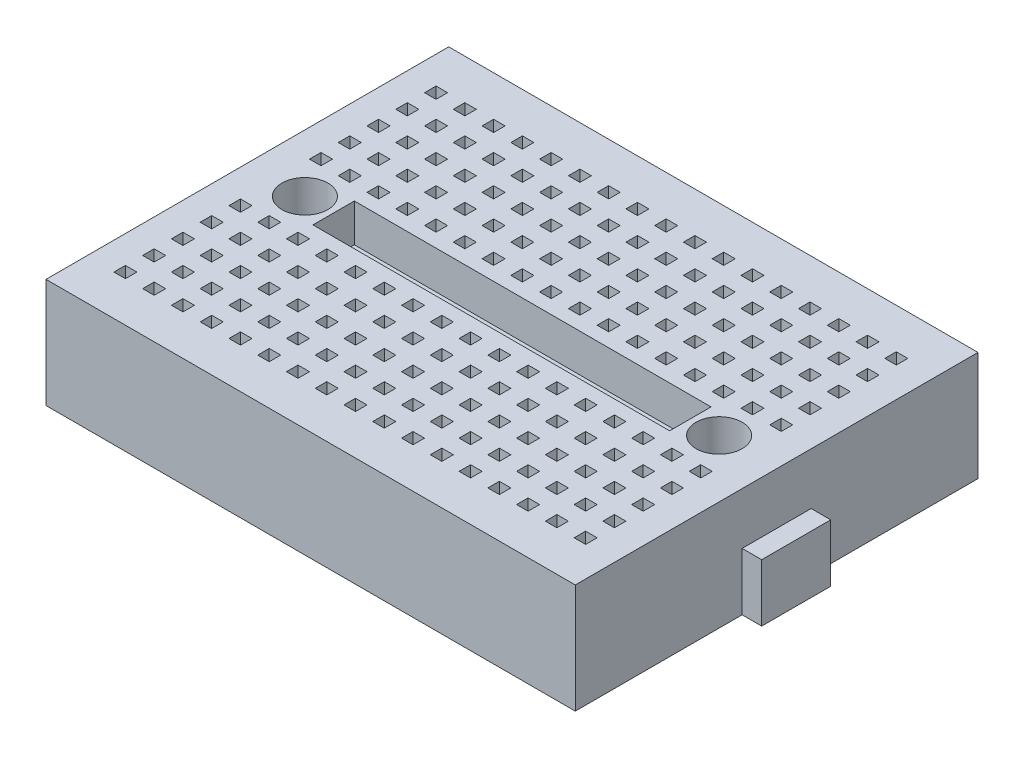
from build123d import *

# Parameters (mm, degrees)
CROQUIS1_W              = 46
CROQUIS1_H              = 35
SALIENTE_EXTRUIR1_DEPTH = 9.5
CROQUIS2_W              = 6
CROQUIS2_H              = 5
SALIENTE_EXTRUIR2_DEPTH = 1.7
CROQUIS3_W              = 31
CROQUIS3_H              = 3.6
CORTAR_EXTRUIR1_DEPTH   = 3.3
CROQUIS4_R              = 2
CORTAR_EXTRUIR2_DEPTH   = 3.5
CROQUIS5_W              = 4.5
CROQUIS5_H              = 5
SALIENTE_EXTRUIR3_DEPTH = 1.5
CROQUIS6_W              = 1
CROQUIS6_H              = 1
CORTAR_EXTRUIR3_DEPTH   = 3


with BuildPart() as part:
    # Croquis1 → Saliente-Extruir1 (new body)
    with BuildSketch(Plane(origin=(0, 0, 0), x_dir=(1, 0, 0), z_dir=(0, 1, 0))):
        with Locations((23, 17.5)):
            Rectangle(CROQUIS1_W, CROQUIS1_H)
    extrude(amount=SALIENTE_EXTRUIR1_DEPTH)

    # Croquis2 → Saliente-Extruir2 (add)
    with BuildSketch(Plane(origin=(46, 0, 0), x_dir=(0, 0, -1), z_dir=(1, 0, 0))):
        with Locations((17.5, 2.5)):
            Rectangle(CROQUIS2_W, CROQUIS2_H)
    extrude(amount=SALIENTE_EXTRUIR2_DEPTH)

    # Croquis3 → Cortar-Extruir1 (cut)
    with BuildSketch(Plane(origin=(0, 9.5, 0), x_dir=(1, 0, 0), z_dir=(0, 1, 0))):
        with Locations((23, 17.5)):
            Rectangle(CROQUIS3_W, CROQUIS3_H)
    extrude(amount=-CORTAR_EXTRUIR1_DEPTH, mode=Mode.SUBTRACT)

    # Croquis4 → Cortar-Extruir2 (cut)
    with BuildSketch(Plane(origin=(0, 9.5, 0), x_dir=(1, 0, 0), z_dir=(0, 1, 0))):
        with Locations(Location((41, 17.5, 0), (0, 0, 270))):
            Circle(CROQUIS4_R)
        with Locations(Location((5, 17.5, 0), (0, 0, 270))):
            Circle(CROQUIS4_R)
    extrude(amount=-CORTAR_EXTRUIR2_DEPTH, mode=Mode.SUBTRACT)

    # Croquis5 → Saliente-Extruir3 (add)
    with BuildSketch(Plane(origin=(0, 0, -35), x_dir=(-1, 0, 0), z_dir=(0, 0, -1))):
        with Locations((-23, 2.5)):
            Rectangle(CROQUIS5_W, CROQUIS5_H)
    extrude(amount=SALIENTE_EXTRUIR3_DEPTH)

    # Croquis6 → Cortar-Extruir3 (cut)
    with BuildSketch(Plane(origin=(0, 9.5, 0), x_dir=(1, 0, 0), z_dir=(0, 1, 0))):
        with Locations((2.9, 14)):
            Rectangle(CROQUIS6_W, CROQUIS6_H)
        with Locations((5.4, 14)):
            Rectangle(CROQUIS6_W, CROQUIS6_H)
        with Locations((7.9, 14)):
            Rectangle(CROQUIS6_W, CROQUIS6_H)
        with Locations((10.4, 14)):
            Rectangle(CROQUIS6_W, CROQUIS6_H)
        with Locations((12.9, 14)):
            Rectangle(CROQUIS6_W, CROQUIS6_H)
        with Locations((15.4, 14)):
            Rectangle(CROQUIS6_W, CROQUIS6_H)
        with Locations((17.9, 14)):
            Rectangle(CROQUIS6_W, CROQUIS6_H)
        with Locations((20.4, 14)):
            Rectangle(CROQUIS6_W, CROQUIS6_H)
        with Locations((22.9, 14)):
            Rectangle(CROQUIS6_W, CROQUIS6_H)
        with Locations((25.4, 14)):
            Rectangle(CROQUIS6_W, CROQUIS6_H)
        with Locations((27.9, 14)):
            Rectangle(CROQUIS6_W, CROQUIS6_H)
        with Locations((30.4, 14)):
            Rectangle(CROQUIS6_W, CROQUIS6_H)
        with Locations((32.9, 14)):
            Rectangle(CROQUIS6_W, CROQUIS6_H)
        with Locations((35.4, 14)):
            Rectangle(CROQUIS6_W, CROQUIS6_H)
        with Locations((37.9, 14)):
            Rectangle(CROQUIS6_W, CROQUIS6_H)
        with Locations((40.4, 14)):
            Rectangle(CROQUIS6_W, CROQUIS6_H)
        with Locations((42.9, 14)):
            Rectangle(CROQUIS6_W, CROQUIS6_H)
        with Locations((5.4, 11.5)):
            Rectangle(CROQUIS6_W, CROQUIS6_H)
        with Locations((7.9, 11.5)):
            Rectangle(CROQUIS6_W, CROQUIS6_H)
        with Locations((10.4, 11.5)):
            Rectangle(CROQUIS6_W, CROQUIS6_H)
        with Locations((12.9, 11.5)):
            Rectangle(CROQUIS6_W, CROQUIS6_H)
        with Locations((15.4, 11.5)):
            Rectangle(CROQUIS6_W, CROQUIS6_H)
        with Locations((17.9, 11.5)):
            Rectangle(CROQUIS6_W, CROQUIS6_H)
        with Locations((20.4, 11.5)):
            Rectangle(CROQUIS6_W, CROQUIS6_H)
        with Locations((22.9, 11.5)):
            Rectangle(CROQUIS6_W, CROQUIS6_H)
        with Locations((25.4, 11.5)):
            Rectangle(CROQUIS6_W, CROQUIS6_H)
        with Locations((27.9, 11.5)):
            Rectangle(CROQUIS6_W, CROQUIS6_H)
        with Locations((30.4, 11.5)):
            Rectangle(CROQUIS6_W, CROQUIS6_H)
        with Locations((32.9, 11.5)):
            Rectangle(CROQUIS6_W, CROQUIS6_H)
        with Locations((35.4, 11.5)):
            Rectangle(CROQUIS6_W, CROQUIS6_H)
        with Locations((37.9, 11.5)):
            Rectangle(CROQUIS6_W, CROQUIS6_H)
        with Locations((40.4, 11.5)):
            Rectangle(CROQUIS6_W, CROQUIS6_H)
        with Locations((42.9, 11.5)):
            Rectangle(CROQUIS6_W, CROQUIS6_H)
        with Locations((5.4, 9)):
            Rectangle(CROQUIS6_W, CROQUIS6_H)
        with Locations((7.9, 9)):
            Rectangle(CROQUIS6_W, CROQUIS6_H)
        with Locations((10.4, 9)):
            Rectangle(CROQUIS6_W, CROQUIS6_H)
        with Locations((12.9, 9)):
            Rectangle(CROQUIS6_W, CROQUIS6_H)
        with Locations((15.4, 9)):
            Rectangle(CROQUIS6_W, CROQUIS6_H)
        with Locations((17.9, 9)):
            Rectangle(CROQUIS6_W, CROQUIS6_H)
        with Locations((20.4, 9)):
            Rectangle(CROQUIS6_W, CROQUIS6_H)
        with Locations((22.9, 9)):
            Rectangle(CROQUIS6_W, CROQUIS6_H)
        with Locations((25.4, 9)):
            Rectangle(CROQUIS6_W, CROQUIS6_H)
        with Locations((27.9, 9)):
            Rectangle(CROQUIS6_W, CROQUIS6_H)
        with Locations((30.4, 9)):
            Rectangle(CROQUIS6_W, CROQUIS6_H)
        with Locations((32.9, 9)):
            Rectangle(CROQUIS6_W, CROQUIS6_H)
        with Locations((35.4, 9)):
            Rectangle(CROQUIS6_W, CROQUIS6_H)
        with Locations((37.9, 9)):
            Rectangle(CROQUIS6_W, CROQUIS6_H)
        with Locations((40.4, 9)):
            Rectangle(CROQUIS6_W, CROQUIS6_H)
        with Locations((42.9, 9)):
            Rectangle(CROQUIS6_W, CROQUIS6_H)
        with Locations((5.4, 6.5)):
            Rectangle(CROQUIS6_W, CROQUIS6_H)
        with Locations((7.9, 6.5)):
            Rectangle(CROQUIS6_W, CROQUIS6_H)
        with Locations((10.4, 6.5)):
            Rectangle(CROQUIS6_W, CROQUIS6_H)
        with Locations((12.9, 6.5)):
            Rectangle(CROQUIS6_W, CROQUIS6_H)
        with Locations((15.4, 6.5)):
            Rectangle(CROQUIS6_W, CROQUIS6_H)
        with Locations((17.9, 6.5)):
            Rectangle(CROQUIS6_W, CROQUIS6_H)
        with Locations((20.4, 6.5)):
            Rectangle(CROQUIS6_W, CROQUIS6_H)
        with Locations((22.9, 6.5)):
            Rectangle(CROQUIS6_W, CROQUIS6_H)
        with Locations((25.4, 6.5)):
            Rectangle(CROQUIS6_W, CROQUIS6_H)
        with Locations((27.9, 6.5)):
            Rectangle(CROQUIS6_W, CROQUIS6_H)
        with Locations((30.4, 6.5)):
            Rectangle(CROQUIS6_W, CROQUIS6_H)
        with Locations((32.9, 6.5)):
            Rectangle(CROQUIS6_W, CROQUIS6_H)
        with Locations((35.4, 6.5)):
            Rectangle(CROQUIS6_W, CROQUIS6_H)
        with Locations((37.9, 6.5)):
            Rectangle(CROQUIS6_W, CROQUIS6_H)
        with Locations((40.4, 6.5)):
            Rectangle(CROQUIS6_W, CROQUIS6_H)
        with Locations((42.9, 6.5)):
            Rectangle(CROQUIS6_W, CROQUIS6_H)
        with Locations((5.4, 4)):
            Rectangle(CROQUIS6_W, CROQUIS6_H)
        with Locations((7.9, 4)):
            Rectangle(CROQUIS6_W, CROQUIS6_H)
        with Locations((10.4, 4)):
            Rectangle(CROQUIS6_W, CROQUIS6_H)
        with Locations((12.9, 4)):
            Rectangle(CROQUIS6_W, CROQUIS6_H)
        with Locations((15.4, 4)):
            Rectangle(CROQUIS6_W, CROQUIS6_H)
        with Locations((17.9, 4)):
            Rectangle(CROQUIS6_W, CROQUIS6_H)
        with Locations((20.4, 4)):
            Rectangle(CROQUIS6_W, CROQUIS6_H)
        with Locations((22.9, 4)):
            Rectangle(CROQUIS6_W, CROQUIS6_H)
        with Locations((25.4, 4)):
            Rectangle(CROQUIS6_W, CROQUIS6_H)
        with Locations((27.9, 4)):
            Rectangle(CROQUIS6_W, CROQUIS6_H)
        with Locations((30.4, 4)):
            Rectangle(CROQUIS6_W, CROQUIS6_H)
        with Locations((32.9, 4)):
            Rectangle(CROQUIS6_W, CROQUIS6_H)
        with Locations((35.4, 4)):
            Rectangle(CROQUIS6_W, CROQUIS6_H)
        with Locations((37.9, 4)):
            Rectangle(CROQUIS6_W, CROQUIS6_H)
        with Locations((40.4, 4)):
            Rectangle(CROQUIS6_W, CROQUIS6_H)
        with Locations((42.9, 4)):
            Rectangle(CROQUIS6_W, CROQUIS6_H)
        with Locations((2.9, 11.5)):
            Rectangle(CROQUIS6_W, CROQUIS6_H)
        with Locations((2.9, 9)):
            Rectangle(CROQUIS6_W, CROQUIS6_H)
        with Locations((2.9, 6.5)):
            Rectangle(CROQUIS6_W, CROQUIS6_H)
        with Locations((2.9, 4)):
            Rectangle(CROQUIS6_W, CROQUIS6_H)
        with Locations((2.9, 31)):
            Rectangle(CROQUIS6_W, CROQUIS6_H)
        with Locations((2.9, 28.5)):
            Rectangle(CROQUIS6_W, CROQUIS6_H)
        with Locations((2.9, 26)):
            Rectangle(CROQUIS6_W, CROQUIS6_H)
        with Locations((2.9, 23.5)):
            Rectangle(CROQUIS6_W, CROQUIS6_H)
        with Locations((42.9, 31)):
            Rectangle(CROQUIS6_W, CROQUIS6_H)
        with Locations((40.4, 31)):
            Rectangle(CROQUIS6_W, CROQUIS6_H)
        with Locations((37.9, 31)):
            Rectangle(CROQUIS6_W, CROQUIS6_H)
        with Locations((35.4, 31)):
            Rectangle(CROQUIS6_W, CROQUIS6_H)
        with Locations((32.9, 31)):
            Rectangle(CROQUIS6_W, CROQUIS6_H)
        with Locations((30.4, 31)):
            Rectangle(CROQUIS6_W, CROQUIS6_H)
        with Locations((27.9, 31)):
            Rectangle(CROQUIS6_W, CROQUIS6_H)
        with Locations((25.4, 31)):
            Rectangle(CROQUIS6_W, CROQUIS6_H)
        with Locations((22.9, 31)):
            Rectangle(CROQUIS6_W, CROQUIS6_H)
        with Locations((20.4, 31)):
            Rectangle(CROQUIS6_W, CROQUIS6_H)
        with Locations((17.9, 31)):
            Rectangle(CROQUIS6_W, CROQUIS6_H)
        with Locations((15.4, 31)):
            Rectangle(CROQUIS6_W, CROQUIS6_H)
        with Locations((12.9, 31)):
            Rectangle(CROQUIS6_W, CROQUIS6_H)
        with Locations((10.4, 31)):
            Rectangle(CROQUIS6_W, CROQUIS6_H)
        with Locations((7.9, 31)):
            Rectangle(CROQUIS6_W, CROQUIS6_H)
        with Locations((5.4, 31)):
            Rectangle(CROQUIS6_W, CROQUIS6_H)
        with Locations((42.9, 28.5)):
            Rectangle(CROQUIS6_W, CROQUIS6_H)
        with Locations((40.4, 28.5)):
            Rectangle(CROQUIS6_W, CROQUIS6_H)
        with Locations((37.9, 28.5)):
            Rectangle(CROQUIS6_W, CROQUIS6_H)
        with Locations((35.4, 28.5)):
            Rectangle(CROQUIS6_W, CROQUIS6_H)
        with Locations((32.9, 28.5)):
            Rectangle(CROQUIS6_W, CROQUIS6_H)
        with Locations((30.4, 28.5)):
            Rectangle(CROQUIS6_W, CROQUIS6_H)
        with Locations((27.9, 28.5)):
            Rectangle(CROQUIS6_W, CROQUIS6_H)
        with Locations((25.4, 28.5)):
            Rectangle(CROQUIS6_W, CROQUIS6_H)
        with Locations((22.9, 28.5)):
            Rectangle(CROQUIS6_W, CROQUIS6_H)
        with Locations((20.4, 28.5)):
            Rectangle(CROQUIS6_W, CROQUIS6_H)
        with Locations((17.9, 28.5)):
            Rectangle(CROQUIS6_W, CROQUIS6_H)
        with Locations((15.4, 28.5)):
            Rectangle(CROQUIS6_W, CROQUIS6_H)
        with Locations((12.9, 28.5)):
            Rectangle(CROQUIS6_W, CROQUIS6_H)
        with Locations((10.4, 28.5)):
            Rectangle(CROQUIS6_W, CROQUIS6_H)
        with Locations((7.9, 28.5)):
            Rectangle(CROQUIS6_W, CROQUIS6_H)
        with Locations((5.4, 28.5)):
            Rectangle(CROQUIS6_W, CROQUIS6_H)
        with Locations((42.9, 26)):
            Rectangle(CROQUIS6_W, CROQUIS6_H)
        with Locations((40.4, 26)):
            Rectangle(CROQUIS6_W, CROQUIS6_H)
        with Locations((37.9, 26)):
            Rectangle(CROQUIS6_W, CROQUIS6_H)
        with Locations((35.4, 26)):
            Rectangle(CROQUIS6_W, CROQUIS6_H)
        with Locations((32.9, 26)):
            Rectangle(CROQUIS6_W, CROQUIS6_H)
        with Locations((30.4, 26)):
            Rectangle(CROQUIS6_W, CROQUIS6_H)
        with Locations((27.9, 26)):
            Rectangle(CROQUIS6_W, CROQUIS6_H)
        with Locations((25.4, 26)):
            Rectangle(CROQUIS6_W, CROQUIS6_H)
        with Locations((22.9, 26)):
            Rectangle(CROQUIS6_W, CROQUIS6_H)
        with Locations((20.4, 26)):
            Rectangle(CROQUIS6_W, CROQUIS6_H)
        with Locations((17.9, 26)):
            Rectangle(CROQUIS6_W, CROQUIS6_H)
        with Locations((15.4, 26)):
            Rectangle(CROQUIS6_W, CROQUIS6_H)
        with Locations((12.9, 26)):
            Rectangle(CROQUIS6_W, CROQUIS6_H)
        with Locations((10.4, 26)):
            Rectangle(CROQUIS6_W, CROQUIS6_H)
        with Locations((7.9, 26)):
            Rectangle(CROQUIS6_W, CROQUIS6_H)
        with Locations((5.4, 26)):
            Rectangle(CROQUIS6_W, CROQUIS6_H)
        with Locations((42.9, 23.5)):
            Rectangle(CROQUIS6_W, CROQUIS6_H)
        with Locations((40.4, 23.5)):
            Rectangle(CROQUIS6_W, CROQUIS6_H)
        with Locations((37.9, 23.5)):
            Rectangle(CROQUIS6_W, CROQUIS6_H)
        with Locations((35.4, 23.5)):
            Rectangle(CROQUIS6_W, CROQUIS6_H)
        with Locations((32.9, 23.5)):
            Rectangle(CROQUIS6_W, CROQUIS6_H)
        with Locations((30.4, 23.5)):
            Rectangle(CROQUIS6_W, CROQUIS6_H)
        with Locations((27.9, 23.5)):
            Rectangle(CROQUIS6_W, CROQUIS6_H)
        with Locations((25.4, 23.5)):
            Rectangle(CROQUIS6_W, CROQUIS6_H)
        with Locations((22.9, 23.5)):
            Rectangle(CROQUIS6_W, CROQUIS6_H)
        with Locations((20.4, 23.5)):
            Rectangle(CROQUIS6_W, CROQUIS6_H)
        with Locations((17.9, 23.5)):
            Rectangle(CROQUIS6_W, CROQUIS6_H)
        with Locations((15.4, 23.5)):
            Rectangle(CROQUIS6_W, CROQUIS6_H)
        with Locations((12.9, 23.5)):
            Rectangle(CROQUIS6_W, CROQUIS6_H)
        with Locations((10.4, 23.5)):
            Rectangle(CROQUIS6_W, CROQUIS6_H)
        with Locations((7.9, 23.5)):
            Rectangle(CROQUIS6_W, CROQUIS6_H)
        with Locations((5.4, 23.5)):
            Rectangle(CROQUIS6_W, CROQUIS6_H)
        with Locations((42.9, 21)):
            Rectangle(CROQUIS6_W, CROQUIS6_H)
        with Locations((40.4, 21)):
            Rectangle(CROQUIS6_W, CROQUIS6_H)
        with Locations((37.9, 21)):
            Rectangle(CROQUIS6_W, CROQUIS6_H)
        with Locations((35.4, 21)):
            Rectangle(CROQUIS6_W, CROQUIS6_H)
        with Locations((32.9, 21)):
            Rectangle(CROQUIS6_W, CROQUIS6_H)
        with Locations((30.4, 21)):
            Rectangle(CROQUIS6_W, CROQUIS6_H)
        with Locations((27.9, 21)):
            Rectangle(CROQUIS6_W, CROQUIS6_H)
        with Locations((25.4, 21)):
            Rectangle(CROQUIS6_W, CROQUIS6_H)
        with Locations((22.9, 21)):
            Rectangle(CROQUIS6_W, CROQUIS6_H)
        with Locations((20.4, 21)):
            Rectangle(CROQUIS6_W, CROQUIS6_H)
        with Locations((17.9, 21)):
            Rectangle(CROQUIS6_W, CROQUIS6_H)
        with Locations((15.4, 21)):
            Rectangle(CROQUIS6_W, CROQUIS6_H)
        with Locations((12.9, 21)):
            Rectangle(CROQUIS6_W, CROQUIS6_H)
        with Locations((10.4, 21)):
            Rectangle(CROQUIS6_W, CROQUIS6_H)
        with Locations((7.9, 21)):
            Rectangle(CROQUIS6_W, CROQUIS6_H)
        with Locations((5.4, 21)):
            Rectangle(CROQUIS6_W, CROQUIS6_H)
        with Locations((2.9, 21)):
            Rectangle(CROQUIS6_W, CROQUIS6_H)
    extrude(amount=-CORTAR_EXTRUIR3_DEPTH, mode=Mode.SUBTRACT)


solid = part.part
